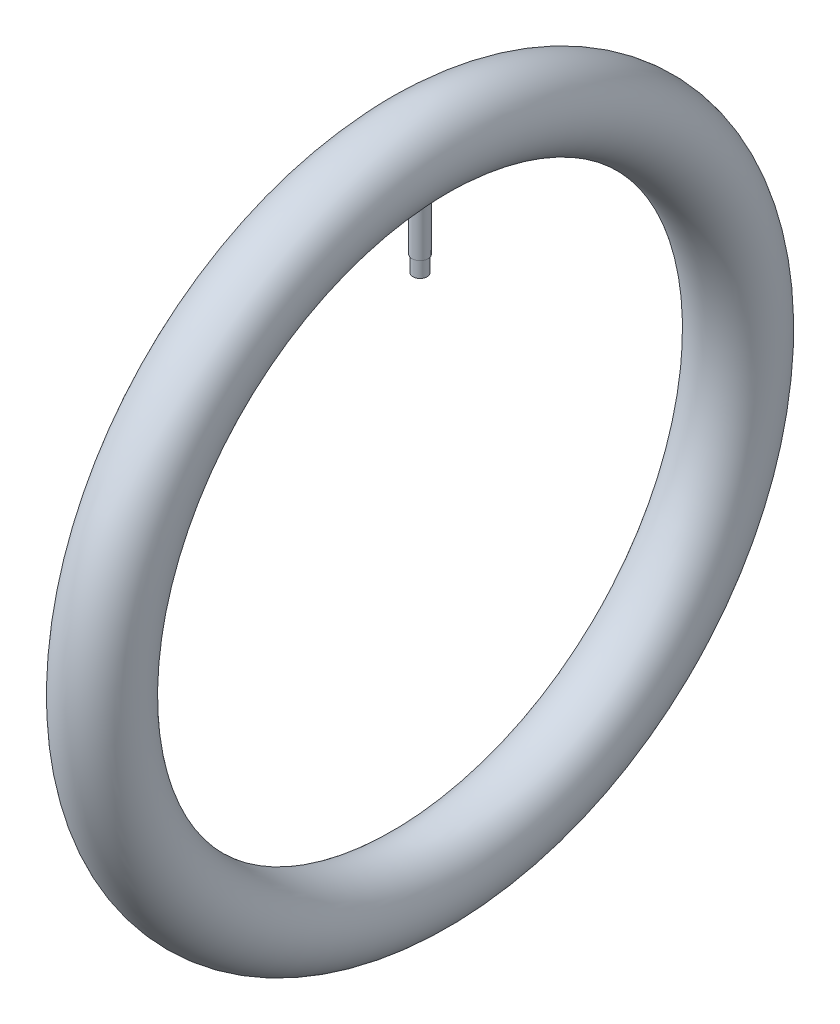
ISO-10303-21;
HEADER;
FILE_DESCRIPTION(('STEP AP214'),'2;1');
FILE_NAME('part.step','',(''),(''),'','','');
FILE_SCHEMA(('AUTOMOTIVE_DESIGN { 1 0 10303 214 1 1 1 1 }'));
ENDSEC;
DATA;
#1=APPLICATION_CONTEXT('core data for automotive mechanical design processes');
#2=APPLICATION_PROTOCOL_DEFINITION('international standard','automotive_design',2000,#1);
#3=PRODUCT_CONTEXT('',#1,'mechanical');
#4=PRODUCT('Part','Part','',(#3));
#5=PRODUCT_RELATED_PRODUCT_CATEGORY('part','',(#4));
#6=PRODUCT_DEFINITION_FORMATION('','',#4);
#7=PRODUCT_DEFINITION_CONTEXT('part definition',#1,'design');
#8=PRODUCT_DEFINITION('design','',#6,#7);
#9=PRODUCT_DEFINITION_SHAPE('','',#8);
#10=(LENGTH_UNIT() NAMED_UNIT(*) SI_UNIT(.MILLI.,.METRE.));
#11=(NAMED_UNIT(*) PLANE_ANGLE_UNIT() SI_UNIT($,.RADIAN.));
#12=(NAMED_UNIT(*) SI_UNIT($,.STERADIAN.) SOLID_ANGLE_UNIT());
#13=UNCERTAINTY_MEASURE_WITH_UNIT(LENGTH_MEASURE(1.E-05),#10,'distance_accuracy_value','');
#14=(GEOMETRIC_REPRESENTATION_CONTEXT(3) GLOBAL_UNCERTAINTY_ASSIGNED_CONTEXT((#13)) GLOBAL_UNIT_ASSIGNED_CONTEXT((#10,
#11,#12)) REPRESENTATION_CONTEXT('',''));
#15=CARTESIAN_POINT('',(0.,0.,0.));
#16=DIRECTION('',(0.,0.,1.));
#17=DIRECTION('',(1.,0.,0.));
#18=AXIS2_PLACEMENT_3D('',#15,#16,#17);
#19=CARTESIAN_POINT('',(0.,200.001,0.));
#20=DIRECTION('',(0.,-1.,0.));
#21=DIRECTION('',(0.,0.,-1.));
#22=AXIS2_PLACEMENT_3D('',#19,#20,#21);
#23=CYLINDRICAL_SURFACE('',#22,4.5);
#24=CARTESIAN_POINT('',(-3.96365629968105,156.282736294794,-4.91499477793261));
#25=CARTESIAN_POINT('',(-2.78237425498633,156.109252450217,-3.54800993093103));
#26=CARTESIAN_POINT('',(-2.99353063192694,154.316436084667,-3.35987713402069));
#27=CARTESIAN_POINT('',(-4.21302538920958,156.336156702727,-4.66937647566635));
#28=CARTESIAN_POINT('',(-2.98035954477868,156.134321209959,-3.3926569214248));
#29=CARTESIAN_POINT('',(-3.18186532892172,154.37390884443,-3.19207596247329));
#30=CARTESIAN_POINT('',(-4.4435663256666,156.390738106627,-4.40070089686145));
#31=CARTESIAN_POINT('',(-3.1709121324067,156.161819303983,-3.21585608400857));
#32=CARTESIAN_POINT('',(-3.35598016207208,154.432634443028,-3.0084993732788));
#33=CARTESIAN_POINT('',(-4.861080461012,156.496255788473,-3.82403102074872));
#34=CARTESIAN_POINT('',(-3.52279799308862,156.217741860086,-2.82360093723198));
#35=CARTESIAN_POINT('',(-3.67130552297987,154.546170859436,-2.61442298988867));
#36=CARTESIAN_POINT('',(-5.04804839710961,156.547191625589,-3.51603198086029));
#37=CARTESIAN_POINT('',(-3.68481416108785,156.246193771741,-2.60842215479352));
#38=CARTESIAN_POINT('',(-3.81251207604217,154.600981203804,-2.40391994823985));
#39=CARTESIAN_POINT('',(-5.37509358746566,156.640210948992,-2.86448778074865));
#40=CARTESIAN_POINT('',(-3.97149624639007,156.299783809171,-2.14298639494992));
#41=CARTESIAN_POINT('',(-4.05951124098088,154.701081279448,-1.95856303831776));
#42=CARTESIAN_POINT('',(-5.51456987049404,156.68217864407,-2.52055421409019));
#43=CARTESIAN_POINT('',(-4.09661153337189,156.325004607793,-1.89203452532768));
#44=CARTESIAN_POINT('',(-4.16484997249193,154.746246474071,-1.72344301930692));
#45=CARTESIAN_POINT('',(-5.738671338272,156.751280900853,-1.80994208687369));
#46=CARTESIAN_POINT('',(-4.29850886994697,156.36714443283,-1.36679484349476));
#47=CARTESIAN_POINT('',(-4.33410143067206,154.820616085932,-1.23760832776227));
#48=CARTESIAN_POINT('',(-5.82331490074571,156.778420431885,-1.44327119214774));
#49=CARTESIAN_POINT('',(-4.37613529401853,156.384223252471,-1.09168269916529));
#50=CARTESIAN_POINT('',(-4.39802803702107,154.849825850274,-0.986898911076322));
#51=CARTESIAN_POINT('',(-5.9324053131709,156.813661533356,-0.712641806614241));
#52=CARTESIAN_POINT('',(-4.47598524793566,156.40642234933,-0.540966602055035));
#53=CARTESIAN_POINT('',(-4.48041799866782,154.887755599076,-0.487310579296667));
#54=CARTESIAN_POINT('',(-5.95903879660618,156.822454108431,-0.349119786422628));
#55=CARTESIAN_POINT('',(-4.50064987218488,156.412070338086,-0.264694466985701));
#56=CARTESIAN_POINT('',(-4.50053279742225,154.897219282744,-0.238731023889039));
#57=CARTESIAN_POINT('',(-5.95759969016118,156.821981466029,0.377743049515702));
#58=CARTESIAN_POINT('',(-4.49932417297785,156.41176915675,0.286414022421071));
#59=CARTESIAN_POINT('',(-4.49944591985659,154.896710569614,0.258303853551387));
#60=CARTESIAN_POINT('',(-5.92953610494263,156.812719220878,0.74108388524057));
#61=CARTESIAN_POINT('',(-4.47333619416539,156.405820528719,0.562496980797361));
#62=CARTESIAN_POINT('',(-4.47825104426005,154.88674137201,0.506759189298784));
#63=CARTESIAN_POINT('',(-5.82142620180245,156.777826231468,1.44622033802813));
#64=CARTESIAN_POINT('',(-4.37443419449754,156.383858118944,1.09375446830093));
#65=CARTESIAN_POINT('',(-4.39660160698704,154.849186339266,0.988914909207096));
#66=CARTESIAN_POINT('',(-5.74292314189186,156.752681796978,1.78833528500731));
#67=CARTESIAN_POINT('',(-4.30250502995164,156.368054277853,1.35036713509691));
#68=CARTESIAN_POINT('',(-4.33731258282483,154.822123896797,1.22283430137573));
#69=CARTESIAN_POINT('',(-5.53807453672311,156.689348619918,2.45313109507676));
#70=CARTESIAN_POINT('',(-4.11778198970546,156.32935781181,1.84228459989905));
#71=CARTESIAN_POINT('',(-4.18260174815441,154.753962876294,1.67734841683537));
#72=CARTESIAN_POINT('',(-5.41172196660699,156.651157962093,2.77580909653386));
#73=CARTESIAN_POINT('',(-4.00431772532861,156.306337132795,2.07827985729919));
#74=CARTESIAN_POINT('',(-4.08717463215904,154.712862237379,1.89794117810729));
#75=CARTESIAN_POINT('',(-5.11107202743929,156.564737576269,3.40186107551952));
#76=CARTESIAN_POINT('',(-3.73977255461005,156.256165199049,2.5275846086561));
#77=CARTESIAN_POINT('',(-3.86011034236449,154.619862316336,2.32588412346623));
#78=CARTESIAN_POINT('',(-4.93561940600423,156.516273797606,3.70452015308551));
#79=CARTESIAN_POINT('',(-3.58703812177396,156.228816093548,2.74036620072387));
#80=CARTESIAN_POINT('',(-3.72760067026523,154.567711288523,2.53274439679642));
#81=CARTESIAN_POINT('',(-4.54302349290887,156.415123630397,4.27395900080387));
#82=CARTESIAN_POINT('',(-3.25404787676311,156.174473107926,3.13077423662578));
#83=CARTESIAN_POINT('',(-3.43109466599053,154.458872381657,2.92189409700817));
#84=CARTESIAN_POINT('',(-4.32586934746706,156.362436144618,4.54072939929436));
#85=CARTESIAN_POINT('',(-3.07312201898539,156.14744085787,3.30819885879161));
#86=CARTESIAN_POINT('',(-3.26709013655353,154.402183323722,3.1041771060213));
#87=CARTESIAN_POINT('',(-3.84538936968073,156.256122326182,5.04220224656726));
#88=CARTESIAN_POINT('',(-2.68472495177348,156.096035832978,3.63192849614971));
#89=CARTESIAN_POINT('',(-2.90421015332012,154.287802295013,3.44678869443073));
#90=CARTESIAN_POINT('',(-3.58052778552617,156.202546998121,5.27512668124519));
#91=CARTESIAN_POINT('',(-2.47624830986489,156.071896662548,3.77590868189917));
#92=CARTESIAN_POINT('',(-2.70417483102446,154.230165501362,3.60590060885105));
#93=CARTESIAN_POINT('',(-3.01803741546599,156.102661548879,5.68871276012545));
#94=CARTESIAN_POINT('',(-2.04869467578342,156.029938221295,4.02304504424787));
#95=CARTESIAN_POINT('',(-2.27935692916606,154.122714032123,3.88839129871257));
#96=CARTESIAN_POINT('',(-2.72040944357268,156.056351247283,5.86937570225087));
#97=CARTESIAN_POINT('',(-1.82983687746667,156.012256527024,4.12533412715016));
#98=CARTESIAN_POINT('',(-2.05457496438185,154.07289916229,4.0117709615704));
#99=CARTESIAN_POINT('',(-2.10179604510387,155.976440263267,6.17201135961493));
#100=CARTESIAN_POINT('',(-1.38979994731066,155.98374743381,4.29155777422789));
#101=CARTESIAN_POINT('',(-1.58737043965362,153.986944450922,4.21843167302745));
#102=CARTESIAN_POINT('',(-1.78093008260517,155.942779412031,6.29426269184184));
#103=CARTESIAN_POINT('',(-1.16940869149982,155.973029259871,4.35486886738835));
#104=CARTESIAN_POINT('',(-1.34503810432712,153.950739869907,4.30190308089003));
#105=CARTESIAN_POINT('',(-1.12392972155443,155.89180215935,6.47691088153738));
#106=CARTESIAN_POINT('',(-0.728656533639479,155.957483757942,4.44791657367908));
#107=CARTESIAN_POINT('',(-0.848842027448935,153.895911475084,4.42660710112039));
#108=CARTESIAN_POINT('',(-0.78780027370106,155.874480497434,6.53732764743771));
#109=CARTESIAN_POINT('',(-0.509496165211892,155.952748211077,4.47711797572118));
#110=CARTESIAN_POINT('',(-0.594982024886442,153.877282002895,4.46785330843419));
#111=CARTESIAN_POINT('',(-0.124848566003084,155.85858719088,6.59279376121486));
#112=CARTESIAN_POINT('',(-0.0798442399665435,155.948365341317,4.50412110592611));
#113=CARTESIAN_POINT('',(-0.0942912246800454,153.860188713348,4.50571980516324));
#114=CARTESIAN_POINT('',(0.201779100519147,155.859265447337,6.59045809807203));
#115=CARTESIAN_POINT('',(0.129393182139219,155.948540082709,4.50302104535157));
#116=CARTESIAN_POINT('',(0.152392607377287,153.860918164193,4.50412533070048));
#117=CARTESIAN_POINT('',(0.849832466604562,155.877445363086,6.5269408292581));
#118=CARTESIAN_POINT('',(0.549995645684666,155.953577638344,4.47203017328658));
#119=CARTESIAN_POINT('',(0.641831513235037,153.880470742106,4.46076217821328));
#120=CARTESIAN_POINT('',(1.17125853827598,155.894945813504,6.46576345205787));
#121=CARTESIAN_POINT('',(0.76013553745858,155.958410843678,4.44232135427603));
#122=CARTESIAN_POINT('',(0.884586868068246,153.899292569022,4.41899638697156));
#123=CARTESIAN_POINT('',(1.79519036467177,155.944466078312,6.28809409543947));
#124=CARTESIAN_POINT('',(1.17942138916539,155.973579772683,4.35161709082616));
#125=CARTESIAN_POINT('',(1.3558081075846,153.952554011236,4.29769116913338));
#126=CARTESIAN_POINT('',(2.09790157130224,155.976273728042,6.1724092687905));
#127=CARTESIAN_POINT('',(1.38750443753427,155.983753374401,4.29155498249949));
#128=CARTESIAN_POINT('',(1.5844291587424,153.986765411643,4.21870293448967));
#129=CARTESIAN_POINT('',(2.68161428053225,156.051025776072,5.8897600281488));
#130=CARTESIAN_POINT('',(1.8021259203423,156.010319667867,4.13660052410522));
#131=CARTESIAN_POINT('',(2.02527512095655,154.067170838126,4.02569122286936));
#132=CARTESIAN_POINT('',(2.96261184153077,156.093972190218,5.72278633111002));
#133=CARTESIAN_POINT('',(2.00799659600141,156.026594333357,4.04237939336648));
#134=CARTESIAN_POINT('',(2.23749705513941,154.113367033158,3.91166140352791));
#135=CARTESIAN_POINT('',(3.50373543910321,156.1879945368,5.33688402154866));
#136=CARTESIAN_POINT('',(2.41701994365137,156.065578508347,3.81340505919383));
#137=CARTESIAN_POINT('',(2.64617781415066,154.214510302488,3.64808499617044));
#138=CARTESIAN_POINT('',(3.76305124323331,156.23926528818,5.11662515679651));
#139=CARTESIAN_POINT('',(2.61978028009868,156.088339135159,3.67831542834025));
#140=CARTESIAN_POINT('',(2.84202471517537,154.2696671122,3.49762894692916));
#141=CARTESIAN_POINT('',(4.24552378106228,156.343707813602,4.63258367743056));
#142=CARTESIAN_POINT('',(3.00710175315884,156.138086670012,3.36850775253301));
#143=CARTESIAN_POINT('',(3.20640956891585,154.38203318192,3.16693725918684));
#144=CARTESIAN_POINT('',(4.4686753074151,156.396879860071,4.36879480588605));
#145=CARTESIAN_POINT('',(3.19192392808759,156.165007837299,3.19440039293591));
#146=CARTESIAN_POINT('',(3.37494358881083,154.439242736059,2.98669733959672));
#147=CARTESIAN_POINT('',(4.87478255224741,156.499944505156,3.80204310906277));
#148=CARTESIAN_POINT('',(3.53465208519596,156.219790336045,2.80825038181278));
#149=CARTESIAN_POINT('',(3.6816539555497,154.550140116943,2.59939556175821));
#150=CARTESIAN_POINT('',(5.05744521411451,156.54981147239,3.49881837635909));
#151=CARTESIAN_POINT('',(3.69303396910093,156.247688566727,2.5961815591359));
#152=CARTESIAN_POINT('',(3.81960897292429,154.603800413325,2.39215436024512));
#153=CARTESIAN_POINT('',(5.37552924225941,156.640389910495,2.86205671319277));
#154=CARTESIAN_POINT('',(3.97199361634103,156.2999199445,2.14104827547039));
#155=CARTESIAN_POINT('',(4.05984026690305,154.701273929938,1.95690067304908));
#156=CARTESIAN_POINT('',(5.51095665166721,156.681102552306,2.5285236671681));
#157=CARTESIAN_POINT('',(4.09341145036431,156.324367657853,1.89774025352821));
#158=CARTESIAN_POINT('',(4.16212110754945,154.745088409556,1.72889084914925));
#159=CARTESIAN_POINT('',(5.73050438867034,156.748726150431,1.83914468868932));
#160=CARTESIAN_POINT('',(4.29113403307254,156.365575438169,1.38843940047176));
#161=CARTESIAN_POINT('',(4.32793338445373,154.817866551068,1.25757442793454));
#162=CARTESIAN_POINT('',(5.81452868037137,156.775611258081,1.48325835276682));
#163=CARTESIAN_POINT('',(4.36811973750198,156.382465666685,1.12164504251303));
#164=CARTESIAN_POINT('',(4.39139229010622,154.846802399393,1.01424012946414));
#165=CARTESIAN_POINT('',(5.92777542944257,156.812140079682,0.760028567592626));
#166=CARTESIAN_POINT('',(4.47170804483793,156.405449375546,0.576869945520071));
#167=CARTESIAN_POINT('',(4.47692130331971,154.886118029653,0.519713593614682));
#168=CARTESIAN_POINT('',(5.95701068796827,156.821787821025,0.39268781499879));
#169=CARTESIAN_POINT('',(4.49878097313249,156.411645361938,0.297751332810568));
#170=CARTESIAN_POINT('',(4.49900107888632,154.896502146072,0.268523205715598));
#171=CARTESIAN_POINT('',(5.9595286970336,156.822615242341,-0.330820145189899));
#172=CARTESIAN_POINT('',(4.50110177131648,156.41217340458,-0.250812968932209));
#173=CARTESIAN_POINT('',(4.50090279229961,154.897392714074,-0.226217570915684));
#174=CARTESIAN_POINT('',(5.93451725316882,156.814357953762,-0.686980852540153));
#175=CARTESIAN_POINT('',(4.47794141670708,156.406869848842,-0.521480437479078));
#176=CARTESIAN_POINT('',(4.48201303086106,154.88850517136,-0.469763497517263));
#177=CARTESIAN_POINT('',(5.83293987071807,156.781517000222,-1.38930064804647));
#178=CARTESIAN_POINT('',(4.38495216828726,156.386172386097,-1.05101159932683));
#179=CARTESIAN_POINT('',(4.40529724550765,154.853158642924,-0.949995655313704));
#180=CARTESIAN_POINT('',(5.75637223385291,156.756932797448,-1.73545940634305));
#181=CARTESIAN_POINT('',(4.31473299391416,156.3706928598,-1.31093086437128));
#182=CARTESIAN_POINT('',(4.34746993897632,154.826699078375,-1.18668166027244));
#183=CARTESIAN_POINT('',(5.5546549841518,156.694395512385,-2.40727764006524));
#184=CARTESIAN_POINT('',(4.13266884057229,156.332410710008,-1.80861736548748));
#185=CARTESIAN_POINT('',(4.1951240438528,154.759394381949,-1.64600054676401));
#186=CARTESIAN_POINT('',(5.42965927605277,156.656484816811,-2.73299829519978));
#187=CARTESIAN_POINT('',(4.02028493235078,156.309501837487,-2.04718543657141));
#188=CARTESIAN_POINT('',(4.10072169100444,154.718594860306,-1.86867537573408));
#189=CARTESIAN_POINT('',(5.13484518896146,156.571421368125,-3.35716387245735));
#190=CARTESIAN_POINT('',(3.76057844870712,156.259990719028,-2.49579104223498));
#191=CARTESIAN_POINT('',(3.87806489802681,154.627054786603,-2.29533285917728));
#192=CARTESIAN_POINT('',(4.96501678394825,156.524266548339,-3.65560267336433));
#193=CARTESIAN_POINT('',(3.61248760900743,156.233276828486,-2.70611271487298));
#194=CARTESIAN_POINT('',(3.74980288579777,154.57631201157,-2.49931131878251));
#195=CARTESIAN_POINT('',(4.57697381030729,156.423508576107,-4.23016608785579));
#196=CARTESIAN_POINT('',(3.28242496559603,156.178834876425,-3.10139709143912));
#197=CARTESIAN_POINT('',(3.45673546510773,154.467894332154,-2.89196924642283));
#198=CARTESIAN_POINT('',(4.35702562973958,156.369717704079,-4.50482571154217));
#199=CARTESIAN_POINT('',(3.09867879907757,156.151081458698,-3.28463164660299));
#200=CARTESIAN_POINT('',(3.29062075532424,154.410017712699,-3.07964541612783));
#201=CARTESIAN_POINT('',(3.87884547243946,156.263179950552,-5.01030399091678));
#202=CARTESIAN_POINT('',(2.71143925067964,156.09933797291,-3.61171811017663));
#203=CARTESIAN_POINT('',(2.92947769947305,154.295395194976,-3.4249971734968));
#204=CARTESIAN_POINT('',(3.62060632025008,156.210433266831,-5.24111441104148));
#205=CARTESIAN_POINT('',(2.50759217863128,156.075403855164,-3.75496494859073));
#206=CARTESIAN_POINT('',(2.7344439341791,154.238649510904,-3.58266712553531));
#207=CARTESIAN_POINT('',(3.06551102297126,156.110428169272,-5.65773348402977));
#208=CARTESIAN_POINT('',(2.08404848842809,156.033028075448,-4.00509810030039));
#209=CARTESIAN_POINT('',(2.31521112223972,154.131068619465,-3.86723348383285));
#210=CARTESIAN_POINT('',(2.76787264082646,156.063333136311,-5.84232019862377));
#211=CARTESIAN_POINT('',(1.86435352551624,156.01487665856,-4.1101097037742));
#212=CARTESIAN_POINT('',(2.09042129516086,154.080409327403,-3.99329438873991));
#213=CARTESIAN_POINT('',(2.14709524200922,155.981562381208,-6.15314395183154));
#214=CARTESIAN_POINT('',(1.42129837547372,155.985451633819,-4.28156856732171));
#215=CARTESIAN_POINT('',(1.62158242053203,153.992453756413,-4.2055487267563));
#216=CARTESIAN_POINT('',(1.82396221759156,155.946883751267,-6.27939465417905));
#217=CARTESIAN_POINT('',(1.19871889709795,155.974324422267,-4.3471828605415));
#218=CARTESIAN_POINT('',(1.37753789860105,153.955154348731,-4.29175149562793));
#219=CARTESIAN_POINT('',(1.17125648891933,155.894818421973,-6.46624475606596));
#220=CARTESIAN_POINT('',(0.759997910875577,155.958360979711,-4.44260042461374));
#221=CARTESIAN_POINT('',(0.884585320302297,153.899155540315,-4.4193250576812));
#222=CARTESIAN_POINT('',(0.842141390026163,155.876959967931,-6.52863978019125));
#223=CARTESIAN_POINT('',(0.544939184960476,155.953442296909,-4.47286048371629));
#224=CARTESIAN_POINT('',(0.63602286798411,153.879948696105,-4.46192205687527));
#225=CARTESIAN_POINT('',(0.178679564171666,155.858899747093,-6.5917323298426));
#226=CARTESIAN_POINT('',(0.114460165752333,155.94844013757,-4.50363981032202));
#227=CARTESIAN_POINT('',(0.13494680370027,153.860524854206,-4.50499523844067));
#228=CARTESIAN_POINT('',(-0.155665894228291,155.858693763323,-6.59244459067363));
#229=CARTESIAN_POINT('',(-0.0996446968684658,155.948385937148,-4.503978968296));
#230=CARTESIAN_POINT('',(-0.117565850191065,153.860303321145,-4.50548148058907));
#231=CARTESIAN_POINT('',(-0.807321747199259,155.87563396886,-6.53327797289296));
#232=CARTESIAN_POINT('',(-0.522297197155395,155.953074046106,-4.47512350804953));
#233=CARTESIAN_POINT('',(-0.609725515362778,153.878522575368,-4.46508855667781));
#234=CARTESIAN_POINT('',(-1.12481232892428,155.892156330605,-6.47557741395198));
#235=CARTESIAN_POINT('',(-0.729544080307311,155.957617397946,-4.44715390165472));
#236=CARTESIAN_POINT('',(-0.849508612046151,153.896292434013,-4.42569652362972));
#237=CARTESIAN_POINT('',(-1.74627434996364,155.939819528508,-6.30492820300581));
#238=CARTESIAN_POINT('',(-1.14609696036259,155.97211165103,-4.36032932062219));
#239=CARTESIAN_POINT('',(-1.31886454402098,153.94755634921,-4.30918515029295));
#240=CARTESIAN_POINT('',(-2.05024494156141,155.970961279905,-6.19197609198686));
#241=CARTESIAN_POINT('',(-1.3543857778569,155.981984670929,-4.30192887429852));
#242=CARTESIAN_POINT('',(-1.54843673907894,153.981051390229,-4.23206344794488));
#243=CARTESIAN_POINT('',(-2.63991955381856,156.045002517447,-5.91298169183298));
#244=CARTESIAN_POINT('',(-1.77187811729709,156.008081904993,-4.14960936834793));
#245=CARTESIAN_POINT('',(-1.99378539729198,154.060691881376,-4.04154938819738));
#246=CARTESIAN_POINT('',(-2.92539236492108,156.088024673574,-5.74638231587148));
#247=CARTESIAN_POINT('',(-1.98038481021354,156.024253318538,-4.0559962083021));
#248=CARTESIAN_POINT('',(-2.20938724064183,154.106969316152,-3.9277764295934));
#249=CARTESIAN_POINT('',(-3.46758282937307,156.181252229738,-5.36527617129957));
#250=CARTESIAN_POINT('',(-2.38924573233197,156.062678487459,-3.83055556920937));
#251=CARTESIAN_POINT('',(-2.61887374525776,154.207257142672,-3.66747839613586));
#252=CARTESIAN_POINT('',(-3.72429330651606,156.231459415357,-5.15075748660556));
#253=CARTESIAN_POINT('',(-2.5893488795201,156.084811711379,-3.69947104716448));
#254=CARTESIAN_POINT('',(-2.81275298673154,154.261269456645,-3.52094517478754));
#255=CARTESIAN_POINT('',(-3.96365629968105,156.282736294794,-4.91499477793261));
#256=CARTESIAN_POINT('',(-2.78237425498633,156.109252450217,-3.54800993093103));
#257=CARTESIAN_POINT('',(-2.99353063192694,154.316436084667,-3.35987713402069));
#258=(BOUNDED_SURFACE() B_SPLINE_SURFACE(3,2,((#24,#25,#26),(#27,#28,#29),(#30,#31,#32),(#33,
#34,#35),(#36,#37,#38),(#39,#40,#41),(#42,#43,#44),(#45,#46,#47),(#48,#49,#50),(#51,#52,#53),
(#54,#55,#56),(#57,#58,#59),(#60,#61,#62),(#63,#64,#65),(#66,#67,#68),(#69,#70,#71),(#72,#73,
#74),(#75,#76,#77),(#78,#79,#80),(#81,#82,#83),(#84,#85,#86),(#87,#88,#89),(#90,#91,#92),(#93,
#94,#95),(#96,#97,#98),(#99,#100,#101),(#102,#103,#104),(#105,#106,#107),(#108,#109,#110),(#111,
#112,#113),(#114,#115,#116),(#117,#118,#119),(#120,#121,#122),(#123,#124,#125),(#126,#127,#128),
(#129,#130,#131),(#132,#133,#134),(#135,#136,#137),(#138,#139,#140),(#141,#142,#143),(#144,#145,
#146),(#147,#148,#149),(#150,#151,#152),(#153,#154,#155),(#156,#157,#158),(#159,#160,#161),
(#162,#163,#164),(#165,#166,#167),(#168,#169,#170),(#171,#172,#173),(#174,#175,#176),(#177,#178,
#179),(#180,#181,#182),(#183,#184,#185),(#186,#187,#188),(#189,#190,#191),(#192,#193,#194),
(#195,#196,#197),(#198,#199,#200),(#201,#202,#203),(#204,#205,#206),(#207,#208,#209),(#210,#211,
#212),(#213,#214,#215),(#216,#217,#218),(#219,#220,#221),(#222,#223,#224),(#225,#226,#227),
(#228,#229,#230),(#231,#232,#233),(#234,#235,#236),(#237,#238,#239),(#240,#241,#242),(#243,#244,
#245),(#246,#247,#248),(#249,#250,#251),(#252,#253,#254),(#255,#256,#257)),.UNSPECIFIED.,.T.,
.F.,.F.) B_SPLINE_SURFACE_WITH_KNOTS((4,2,2,2,2,2,2,2,2,2,2,2,2,2,2,2,2,2,2,2,2,2,2,2,2,2,2,2,2,
2,2,2,2,2,2,2,2,2,4),(3,3),(0.,1.10534678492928,2.21082700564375,3.32981721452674,
4.44843218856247,5.52409460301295,6.59957994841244,7.64363235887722,8.687838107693,
9.75904441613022,10.8305299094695,11.9462396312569,13.0619216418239,14.1722274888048,
15.282175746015,16.3459453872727,17.4096385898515,18.4580530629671,19.5066574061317,
20.584780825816,21.6630593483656,22.748904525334,23.8346107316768,24.9223392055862,
26.0098135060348,27.0635886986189,28.1173986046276,29.1678866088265,30.2186097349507,
31.3134931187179,32.4085819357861,33.5301275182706,34.6514102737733,35.7402159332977,
36.8287614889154,37.8781560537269,38.9276163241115,39.9883462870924,41.0493403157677),(0.,1.),
.UNSPECIFIED.) GEOMETRIC_REPRESENTATION_ITEM() RATIONAL_B_SPLINE_SURFACE(((1.,0.740528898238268,
1.),(1.,0.746417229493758,1.),(1.,0.75233940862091,1.),(1.,0.763623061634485,1.),(1.,
0.768984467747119,1.),(1.,0.778664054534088,1.),(1.,0.782968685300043,1.),(1.,0.790004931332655,
1.),(1.,0.792737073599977,1.),(1.,0.796276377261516,1.),(1.,0.797153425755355,1.),(1.,
0.797106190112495,1.),(1.,0.796182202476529,1.),(1.,0.79267693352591,1.),(1.,0.790144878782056,
1.),(1.,0.783701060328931,1.),(1.,0.779789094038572,1.),(1.,0.770820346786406,1.),(1.,
0.765736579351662,1.),(1.,0.754964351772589,1.),(1.,0.749275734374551,1.),(1.,0.737618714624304,
1.),(1.,0.731648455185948,1.),(1.,0.720354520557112,1.),(1.,0.715030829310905,1.),(1.,
0.705742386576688,1.),(1.,0.701771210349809,1.),(1.,0.69572192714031,1.),(1.,0.693643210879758,
1.),(1.,0.691736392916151,1.),(1.,0.691818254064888,1.),(1.,0.693998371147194,1.),(1.,
0.696096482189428,1.),(1.,0.701969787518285,1.),(1.,0.705720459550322,1.),(1.,0.714414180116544,
1.),(1.,0.719357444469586,1.),(1.,0.730014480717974,1.),(1.,0.735746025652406,1.),(1.,
0.74723918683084,1.),(1.,0.753000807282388,1.),(1.,0.764012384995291,1.),(1.,0.769258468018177,
1.),(1.,0.778681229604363,1.),(1.,0.782858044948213,1.),(1.,0.78974583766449,1.),(1.,
0.792454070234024,1.),(1.,0.79612437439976,1.),(1.,0.797086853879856,1.),(1.,0.79716951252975,
1.),(1.,0.796345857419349,1.),(1.,0.793048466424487,1.),(1.,0.790574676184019,1.),(1.,
0.784216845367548,1.),(1.,0.780337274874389,1.),(1.,0.771518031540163,1.),(1.,0.766578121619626,
1.),(1.,0.755865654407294,1.),(1.,0.750066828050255,1.),(1.,0.738399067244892,1.),(1.,
0.732530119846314,1.),(1.,0.721241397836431,1.),(1.,0.715835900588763,1.),(1.,0.706343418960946,
1.),(1.,0.702256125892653,1.),(1.,0.696081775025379,1.),(1.,0.693940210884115,1.),(1.,
0.691774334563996,1.),(1.,0.691749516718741,1.),(1.,0.693781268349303,1.),(1.,0.695763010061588,
1.),(1.,0.701420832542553,1.),(1.,0.705097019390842,1.),(1.,0.713718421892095,1.),(1.,
0.718676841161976,1.),(1.,0.729255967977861,1.),(1.,0.734876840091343,1.),(1.,0.740528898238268,1.))) REPRESENTATION_ITEM('') SURFACE());
#259=CARTESIAN_POINT('',(-2.99353063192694,154.316436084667,-3.35987713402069));
#260=CARTESIAN_POINT('',(-2.81275298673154,154.261269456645,-3.52094517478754));
#261=CARTESIAN_POINT('',(-2.61887374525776,154.207257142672,-3.66747839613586));
#262=CARTESIAN_POINT('',(-2.20938724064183,154.106969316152,-3.9277764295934));
#263=CARTESIAN_POINT('',(-1.99378539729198,154.060691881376,-4.04154938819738));
#264=CARTESIAN_POINT('',(-1.54843673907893,153.981051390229,-4.23206344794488));
#265=CARTESIAN_POINT('',(-1.31886454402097,153.94755634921,-4.30918515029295));
#266=CARTESIAN_POINT('',(-0.849508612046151,153.896292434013,-4.42569652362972));
#267=CARTESIAN_POINT('',(-0.609725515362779,153.878522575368,-4.46508855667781));
#268=CARTESIAN_POINT('',(-0.117565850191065,153.860303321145,-4.50548148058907));
#269=CARTESIAN_POINT('',(0.13494680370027,153.860524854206,-4.50499523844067));
#270=CARTESIAN_POINT('',(0.636022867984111,153.879948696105,-4.46192205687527));
#271=CARTESIAN_POINT('',(0.884585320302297,153.899155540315,-4.4193250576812));
#272=CARTESIAN_POINT('',(1.37753789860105,153.955154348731,-4.29175149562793));
#273=CARTESIAN_POINT('',(1.62158242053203,153.992453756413,-4.2055487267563));
#274=CARTESIAN_POINT('',(2.09042129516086,154.080409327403,-3.99329438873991));
#275=CARTESIAN_POINT('',(2.31521112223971,154.131068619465,-3.86723348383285));
#276=CARTESIAN_POINT('',(2.7344439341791,154.238649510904,-3.58266712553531));
#277=CARTESIAN_POINT('',(2.92947769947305,154.295395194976,-3.4249971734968));
#278=CARTESIAN_POINT('',(3.29062075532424,154.410017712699,-3.07964541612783));
#279=CARTESIAN_POINT('',(3.45673546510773,154.467894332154,-2.89196924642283));
#280=CARTESIAN_POINT('',(3.74980288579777,154.57631201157,-2.49931131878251));
#281=CARTESIAN_POINT('',(3.87806489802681,154.627054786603,-2.29533285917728));
#282=CARTESIAN_POINT('',(4.10072169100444,154.718594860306,-1.86867537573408));
#283=CARTESIAN_POINT('',(4.1951240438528,154.759394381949,-1.64600054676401));
#284=CARTESIAN_POINT('',(4.34746993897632,154.826699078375,-1.18668166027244));
#285=CARTESIAN_POINT('',(4.40529724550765,154.853158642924,-0.949995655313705));
#286=CARTESIAN_POINT('',(4.48201303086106,154.88850517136,-0.469763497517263));
#287=CARTESIAN_POINT('',(4.50090279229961,154.897392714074,-0.226217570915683));
#288=CARTESIAN_POINT('',(4.49900107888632,154.896502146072,0.268523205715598));
#289=CARTESIAN_POINT('',(4.47692130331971,154.886118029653,0.519713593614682));
#290=CARTESIAN_POINT('',(4.39139229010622,154.846802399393,1.01424012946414));
#291=CARTESIAN_POINT('',(4.32793338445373,154.817866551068,1.25757442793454));
#292=CARTESIAN_POINT('',(4.16212110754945,154.745088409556,1.72889084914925));
#293=CARTESIAN_POINT('',(4.05984026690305,154.701273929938,1.95690067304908));
#294=CARTESIAN_POINT('',(3.81960897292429,154.603800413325,2.39215436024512));
#295=CARTESIAN_POINT('',(3.6816539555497,154.550140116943,2.59939556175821));
#296=CARTESIAN_POINT('',(3.37494358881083,154.439242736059,2.98669733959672));
#297=CARTESIAN_POINT('',(3.20640956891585,154.38203318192,3.16693725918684));
#298=CARTESIAN_POINT('',(2.84202471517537,154.2696671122,3.49762894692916));
#299=CARTESIAN_POINT('',(2.64617781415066,154.214510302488,3.64808499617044));
#300=CARTESIAN_POINT('',(2.23749705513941,154.113367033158,3.91166140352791));
#301=CARTESIAN_POINT('',(2.02527512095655,154.067170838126,4.02569122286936));
#302=CARTESIAN_POINT('',(1.5844291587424,153.986765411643,4.21870293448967));
#303=CARTESIAN_POINT('',(1.3558081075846,153.952554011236,4.29769116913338));
#304=CARTESIAN_POINT('',(0.884586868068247,153.899292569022,4.41899638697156));
#305=CARTESIAN_POINT('',(0.641831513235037,153.880470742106,4.46076217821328));
#306=CARTESIAN_POINT('',(0.152392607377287,153.860918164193,4.50412533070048));
#307=CARTESIAN_POINT('',(-0.094291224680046,153.860188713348,4.50571980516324));
#308=CARTESIAN_POINT('',(-0.594982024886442,153.877282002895,4.46785330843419));
#309=CARTESIAN_POINT('',(-0.848842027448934,153.895911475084,4.42660710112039));
#310=CARTESIAN_POINT('',(-1.34503810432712,153.950739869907,4.30190308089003));
#311=CARTESIAN_POINT('',(-1.58737043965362,153.986944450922,4.21843167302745));
#312=CARTESIAN_POINT('',(-2.05457496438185,154.07289916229,4.0117709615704));
#313=CARTESIAN_POINT('',(-2.27935692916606,154.122714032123,3.88839129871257));
#314=CARTESIAN_POINT('',(-2.70417483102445,154.230165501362,3.60590060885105));
#315=CARTESIAN_POINT('',(-2.90421015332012,154.287802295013,3.44678869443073));
#316=CARTESIAN_POINT('',(-3.26709013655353,154.402183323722,3.1041771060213));
#317=CARTESIAN_POINT('',(-3.43109466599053,154.458872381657,2.92189409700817));
#318=CARTESIAN_POINT('',(-3.72760067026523,154.567711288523,2.53274439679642));
#319=CARTESIAN_POINT('',(-3.86011034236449,154.619862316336,2.32588412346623));
#320=CARTESIAN_POINT('',(-4.08717463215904,154.712862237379,1.89794117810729));
#321=CARTESIAN_POINT('',(-4.18260174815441,154.753962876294,1.67734841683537));
#322=CARTESIAN_POINT('',(-4.33731258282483,154.822123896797,1.22283430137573));
#323=CARTESIAN_POINT('',(-4.39660160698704,154.849186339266,0.988914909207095));
#324=CARTESIAN_POINT('',(-4.47825104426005,154.88674137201,0.506759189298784));
#325=CARTESIAN_POINT('',(-4.49944591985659,154.896710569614,0.258303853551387));
#326=CARTESIAN_POINT('',(-4.50053279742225,154.897219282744,-0.238731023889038));
#327=CARTESIAN_POINT('',(-4.48041799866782,154.887755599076,-0.487310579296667));
#328=CARTESIAN_POINT('',(-4.39802803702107,154.849825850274,-0.986898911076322));
#329=CARTESIAN_POINT('',(-4.33410143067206,154.820616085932,-1.23760832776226));
#330=CARTESIAN_POINT('',(-4.16484997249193,154.746246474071,-1.72344301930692));
#331=CARTESIAN_POINT('',(-4.05951124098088,154.701081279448,-1.95856303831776));
#332=CARTESIAN_POINT('',(-3.81251207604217,154.600981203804,-2.40391994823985));
#333=CARTESIAN_POINT('',(-3.67130552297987,154.546170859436,-2.61442298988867));
#334=CARTESIAN_POINT('',(-3.35598016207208,154.432634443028,-3.0084993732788));
#335=CARTESIAN_POINT('',(-3.18186532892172,154.37390884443,-3.19207596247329));
#336=CARTESIAN_POINT('',(-2.99353063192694,154.316436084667,-3.35987713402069));
#337=B_SPLINE_CURVE_WITH_KNOTS('',3,(#259,#260,#261,#262,#263,#264,#265,#266,#267,#268,#269,
#270,#271,#272,#273,#274,#275,#276,#277,#278,#279,#280,#281,#282,#283,#284,#285,#286,#287,#288,
#289,#290,#291,#292,#293,#294,#295,#296,#297,#298,#299,#300,#301,#302,#303,#304,#305,#306,#307,
#308,#309,#310,#311,#312,#313,#314,#315,#316,#317,#318,#319,#320,#321,#322,#323,#324,#325,#326,
#327,#328,#329,#330,#331,#332,#333,#334,#335,#336),.UNSPECIFIED.,.T.,.F.,(4,2,2,2,2,2,2,2,2,2,2,
2,2,2,2,2,2,2,2,2,2,2,2,2,2,2,2,2,2,2,2,2,2,2,2,2,2,2,4),(0.,1.06099402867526,2.12172399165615,
3.1711842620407,4.22057882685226,5.30912438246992,6.39793004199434,7.51921279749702,
8.6407583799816,9.73584719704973,10.8307305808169,11.8814537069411,12.93194171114,
13.9857516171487,15.0395268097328,16.1270011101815,17.2147295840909,18.3004357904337,
19.3862809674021,20.4645594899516,21.542682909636,22.5912872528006,23.6397017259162,
24.703394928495,25.7671645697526,26.8771128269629,27.9874186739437,29.1031006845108,
30.2188104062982,31.2902958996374,32.3615022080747,33.4057079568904,34.4497603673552,
35.5252457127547,36.6009081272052,37.7195231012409,38.8385133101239,39.9439935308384,
41.0493403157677),.UNSPECIFIED.);
#338=CARTESIAN_POINT('',(-2.99353063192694,154.316436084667,-3.35987713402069));
#339=VERTEX_POINT('',#338);
#340=EDGE_CURVE('E47',#339,#339,#337,.T.);
#341=ORIENTED_EDGE('',*,*,#340,.T.);
#342=EDGE_LOOP('',(#341));
#343=FACE_BOUND('',#342,.T.);
#344=CARTESIAN_POINT('',(0.,125.,0.));
#345=DIRECTION('',(0.,-1.,0.));
#346=DIRECTION('',(0.,0.,-1.));
#347=AXIS2_PLACEMENT_3D('',#344,#345,#346);
#348=CIRCLE('',#347,4.5);
#349=CARTESIAN_POINT('',(0.,125.,-4.5));
#350=VERTEX_POINT('',#349);
#351=EDGE_CURVE('E51',#350,#350,#348,.T.);
#352=ORIENTED_EDGE('',*,*,#351,.F.);
#353=EDGE_LOOP('',(#352));
#354=FACE_BOUND('',#353,.T.);
#355=ADVANCED_FACE('F34',(#343,#354),#23,.T.);
#356=CARTESIAN_POINT('',(0.,0.,0.));
#357=DIRECTION('',(-1.,0.,0.));
#358=DIRECTION('',(0.,0.,1.));
#359=AXIS2_PLACEMENT_3D('',#356,#357,#358);
#360=TOROIDAL_SURFACE('',#359,178.,22.);
#361=CARTESIAN_POINT('',(-3.96365629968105,156.282736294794,-4.91499477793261));
#362=CARTESIAN_POINT('',(-4.21302538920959,156.336156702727,-4.66937647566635));
#363=CARTESIAN_POINT('',(-4.4435663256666,156.390738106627,-4.40070089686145));
#364=CARTESIAN_POINT('',(-4.861080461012,156.496255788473,-3.82403102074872));
#365=CARTESIAN_POINT('',(-5.04804839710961,156.547191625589,-3.51603198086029));
#366=CARTESIAN_POINT('',(-5.37509358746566,156.640210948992,-2.86448778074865));
#367=CARTESIAN_POINT('',(-5.51456987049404,156.68217864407,-2.52055421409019));
#368=CARTESIAN_POINT('',(-5.738671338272,156.751280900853,-1.80994208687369));
#369=CARTESIAN_POINT('',(-5.82331490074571,156.778420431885,-1.44327119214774));
#370=CARTESIAN_POINT('',(-5.9324053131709,156.813661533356,-0.712641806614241));
#371=CARTESIAN_POINT('',(-5.95903879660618,156.822454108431,-0.349119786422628));
#372=CARTESIAN_POINT('',(-5.95759969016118,156.821981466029,0.377743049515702));
#373=CARTESIAN_POINT('',(-5.92953610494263,156.812719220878,0.74108388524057));
#374=CARTESIAN_POINT('',(-5.82142620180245,156.777826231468,1.44622033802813));
#375=CARTESIAN_POINT('',(-5.74292314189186,156.752681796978,1.78833528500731));
#376=CARTESIAN_POINT('',(-5.53807453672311,156.689348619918,2.45313109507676));
#377=CARTESIAN_POINT('',(-5.41172196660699,156.651157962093,2.77580909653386));
#378=CARTESIAN_POINT('',(-5.1110720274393,156.564737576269,3.40186107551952));
#379=CARTESIAN_POINT('',(-4.93561940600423,156.516273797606,3.70452015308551));
#380=CARTESIAN_POINT('',(-4.54302349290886,156.415123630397,4.27395900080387));
#381=CARTESIAN_POINT('',(-4.32586934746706,156.362436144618,4.54072939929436));
#382=CARTESIAN_POINT('',(-3.84538936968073,156.256122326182,5.04220224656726));
#383=CARTESIAN_POINT('',(-3.58052778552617,156.202546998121,5.27512668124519));
#384=CARTESIAN_POINT('',(-3.01803741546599,156.102661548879,5.68871276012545));
#385=CARTESIAN_POINT('',(-2.72040944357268,156.056351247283,5.86937570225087));
#386=CARTESIAN_POINT('',(-2.10179604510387,155.976440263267,6.17201135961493));
#387=CARTESIAN_POINT('',(-1.78093008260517,155.942779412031,6.29426269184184));
#388=CARTESIAN_POINT('',(-1.12392972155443,155.89180215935,6.47691088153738));
#389=CARTESIAN_POINT('',(-0.78780027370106,155.874480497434,6.53732764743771));
#390=CARTESIAN_POINT('',(-0.124848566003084,155.85858719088,6.59279376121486));
#391=CARTESIAN_POINT('',(0.201779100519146,155.859265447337,6.59045809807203));
#392=CARTESIAN_POINT('',(0.849832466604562,155.877445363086,6.5269408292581));
#393=CARTESIAN_POINT('',(1.17125853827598,155.894945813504,6.46576345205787));
#394=CARTESIAN_POINT('',(1.79519036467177,155.944466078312,6.28809409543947));
#395=CARTESIAN_POINT('',(2.09790157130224,155.976273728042,6.1724092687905));
#396=CARTESIAN_POINT('',(2.68161428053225,156.051025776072,5.8897600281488));
#397=CARTESIAN_POINT('',(2.96261184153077,156.093972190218,5.72278633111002));
#398=CARTESIAN_POINT('',(3.50373543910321,156.1879945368,5.33688402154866));
#399=CARTESIAN_POINT('',(3.76305124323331,156.23926528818,5.11662515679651));
#400=CARTESIAN_POINT('',(4.24552378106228,156.343707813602,4.63258367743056));
#401=CARTESIAN_POINT('',(4.46867530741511,156.396879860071,4.36879480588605));
#402=CARTESIAN_POINT('',(4.87478255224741,156.499944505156,3.80204310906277));
#403=CARTESIAN_POINT('',(5.05744521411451,156.54981147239,3.49881837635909));
#404=CARTESIAN_POINT('',(5.37552924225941,156.640389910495,2.86205671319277));
#405=CARTESIAN_POINT('',(5.51095665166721,156.681102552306,2.5285236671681));
#406=CARTESIAN_POINT('',(5.73050438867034,156.748726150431,1.83914468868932));
#407=CARTESIAN_POINT('',(5.81452868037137,156.775611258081,1.48325835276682));
#408=CARTESIAN_POINT('',(5.92777542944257,156.812140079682,0.760028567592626));
#409=CARTESIAN_POINT('',(5.95701068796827,156.821787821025,0.392687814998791));
#410=CARTESIAN_POINT('',(5.9595286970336,156.822615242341,-0.330820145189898));
#411=CARTESIAN_POINT('',(5.93451725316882,156.814357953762,-0.686980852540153));
#412=CARTESIAN_POINT('',(5.83293987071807,156.781517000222,-1.38930064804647));
#413=CARTESIAN_POINT('',(5.75637223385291,156.756932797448,-1.73545940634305));
#414=CARTESIAN_POINT('',(5.5546549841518,156.694395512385,-2.40727764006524));
#415=CARTESIAN_POINT('',(5.42965927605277,156.656484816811,-2.73299829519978));
#416=CARTESIAN_POINT('',(5.13484518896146,156.571421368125,-3.35716387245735));
#417=CARTESIAN_POINT('',(4.96501678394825,156.524266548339,-3.65560267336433));
#418=CARTESIAN_POINT('',(4.57697381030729,156.423508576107,-4.23016608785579));
#419=CARTESIAN_POINT('',(4.35702562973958,156.369717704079,-4.50482571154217));
#420=CARTESIAN_POINT('',(3.87884547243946,156.263179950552,-5.01030399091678));
#421=CARTESIAN_POINT('',(3.62060632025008,156.210433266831,-5.24111441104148));
#422=CARTESIAN_POINT('',(3.06551102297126,156.110428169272,-5.65773348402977));
#423=CARTESIAN_POINT('',(2.76787264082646,156.063333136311,-5.84232019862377));
#424=CARTESIAN_POINT('',(2.14709524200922,155.981562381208,-6.15314395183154));
#425=CARTESIAN_POINT('',(1.82396221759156,155.946883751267,-6.27939465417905));
#426=CARTESIAN_POINT('',(1.17125648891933,155.894818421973,-6.46624475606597));
#427=CARTESIAN_POINT('',(0.842141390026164,155.876959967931,-6.52863978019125));
#428=CARTESIAN_POINT('',(0.178679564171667,155.858899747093,-6.5917323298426));
#429=CARTESIAN_POINT('',(-0.155665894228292,155.858693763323,-6.59244459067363));
#430=CARTESIAN_POINT('',(-0.80732174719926,155.87563396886,-6.53327797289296));
#431=CARTESIAN_POINT('',(-1.12481232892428,155.892156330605,-6.47557741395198));
#432=CARTESIAN_POINT('',(-1.74627434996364,155.939819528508,-6.30492820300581));
#433=CARTESIAN_POINT('',(-2.05024494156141,155.970961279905,-6.19197609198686));
#434=CARTESIAN_POINT('',(-2.63991955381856,156.045002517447,-5.91298169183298));
#435=CARTESIAN_POINT('',(-2.92539236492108,156.088024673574,-5.74638231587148));
#436=CARTESIAN_POINT('',(-3.46758282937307,156.181252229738,-5.36527617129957));
#437=CARTESIAN_POINT('',(-3.72429330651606,156.231459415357,-5.15075748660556));
#438=CARTESIAN_POINT('',(-3.96365629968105,156.282736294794,-4.91499477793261));
#439=B_SPLINE_CURVE_WITH_KNOTS('',3,(#361,#362,#363,#364,#365,#366,#367,#368,#369,#370,#371,
#372,#373,#374,#375,#376,#377,#378,#379,#380,#381,#382,#383,#384,#385,#386,#387,#388,#389,#390,
#391,#392,#393,#394,#395,#396,#397,#398,#399,#400,#401,#402,#403,#404,#405,#406,#407,#408,#409,
#410,#411,#412,#413,#414,#415,#416,#417,#418,#419,#420,#421,#422,#423,#424,#425,#426,#427,#428,
#429,#430,#431,#432,#433,#434,#435,#436,#437,#438),.UNSPECIFIED.,.T.,.F.,(4,2,2,2,2,2,2,2,2,2,2,
2,2,2,2,2,2,2,2,2,2,2,2,2,2,2,2,2,2,2,2,2,2,2,2,2,2,2,4),(0.,1.10534678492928,2.21082700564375,
3.32981721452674,4.44843218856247,5.52409460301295,6.59957994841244,7.64363235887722,
8.687838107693,9.75904441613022,10.8305299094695,11.9462396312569,13.0619216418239,
14.1722274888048,15.282175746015,16.3459453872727,17.4096385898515,18.4580530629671,
19.5066574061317,20.584780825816,21.6630593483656,22.748904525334,23.8346107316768,
24.9223392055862,26.0098135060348,27.0635886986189,28.1173986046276,29.1678866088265,
30.2186097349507,31.3134931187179,32.4085819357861,33.5301275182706,34.6514102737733,
35.7402159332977,36.8287614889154,37.8781560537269,38.9276163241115,39.9883462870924,
41.0493403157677),.UNSPECIFIED.);
#440=CARTESIAN_POINT('',(-3.96365629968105,156.282736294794,-4.91499477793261));
#441=VERTEX_POINT('',#440);
#442=EDGE_CURVE('E10',#441,#441,#439,.T.);
#443=ORIENTED_EDGE('',*,*,#442,.T.);
#444=EDGE_LOOP('',(#443));
#445=FACE_BOUND('',#444,.T.);
#446=ADVANCED_FACE('F60',(#445),#360,.T.);
#447=CARTESIAN_POINT('',(-4.32398869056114,154.316436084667,-4.8531558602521));
#448=DIRECTION('',(0.737519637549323,-0.155818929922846,-0.657103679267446));
#449=DIRECTION('',(0.180166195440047,0.983150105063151,-0.0309194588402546));
#450=AXIS2_PLACEMENT_3D('',#447,#448,#449);
#451=CIRCLE('',#450,2.);
#452=EDGE_CURVE('',#441,#339,#451,.T.);
#453=ORIENTED_EDGE('',*,*,#442,.F.);
#454=ORIENTED_EDGE('',*,*,#340,.F.);
#455=ORIENTED_EDGE('',*,*,#452,.T.);
#456=ORIENTED_EDGE('',*,*,#452,.F.);
#457=EDGE_LOOP('',(#453,#455,#454,#456));
#458=FACE_BOUND('',#457,.T.);
#459=ADVANCED_FACE('F63',(#458),#258,.F.);
#460=CARTESIAN_POINT('',(0.,125.,0.));
#461=DIRECTION('',(0.,-1.,0.));
#462=DIRECTION('',(0.,0.,-1.));
#463=AXIS2_PLACEMENT_3D('',#460,#461,#462);
#464=PLANE('',#463);
#465=CARTESIAN_POINT('',(0.,125.,0.));
#466=DIRECTION('',(0.,-1.,0.));
#467=DIRECTION('',(0.,0.,-1.));
#468=AXIS2_PLACEMENT_3D('',#465,#466,#467);
#469=CIRCLE('',#468,4.);
#470=CARTESIAN_POINT('',(0.,125.,-4.));
#471=VERTEX_POINT('',#470);
#472=EDGE_CURVE('E108',#471,#471,#469,.T.);
#473=ORIENTED_EDGE('',*,*,#472,.F.);
#474=EDGE_LOOP('',(#473));
#475=FACE_BOUND('',#474,.T.);
#476=ORIENTED_EDGE('',*,*,#351,.T.);
#477=EDGE_LOOP('',(#476));
#478=FACE_BOUND('',#477,.T.);
#479=ADVANCED_FACE('F72',(#475,#478),#464,.T.);
#480=CARTESIAN_POINT('',(0.,125.,0.));
#481=DIRECTION('',(0.,-1.,0.));
#482=DIRECTION('',(0.,0.,-1.));
#483=AXIS2_PLACEMENT_3D('',#480,#481,#482);
#484=CYLINDRICAL_SURFACE('',#483,4.);
#485=ORIENTED_EDGE('',*,*,#472,.T.);
#486=EDGE_LOOP('',(#485));
#487=FACE_BOUND('',#486,.T.);
#488=CARTESIAN_POINT('',(0.,116.,0.));
#489=DIRECTION('',(0.,-1.,0.));
#490=DIRECTION('',(0.,0.,-1.));
#491=AXIS2_PLACEMENT_3D('',#488,#489,#490);
#492=CIRCLE('',#491,4.);
#493=CARTESIAN_POINT('',(0.,116.,-4.));
#494=VERTEX_POINT('',#493);
#495=EDGE_CURVE('E110',#494,#494,#492,.T.);
#496=ORIENTED_EDGE('',*,*,#495,.F.);
#497=EDGE_LOOP('',(#496));
#498=FACE_BOUND('',#497,.T.);
#499=ADVANCED_FACE('F89',(#487,#498),#484,.T.);
#500=CARTESIAN_POINT('',(0.,116.,0.));
#501=DIRECTION('',(0.,1.,0.));
#502=DIRECTION('',(0.,0.,1.));
#503=AXIS2_PLACEMENT_3D('',#500,#501,#502);
#504=PLANE('',#503);
#505=CARTESIAN_POINT('',(0.,116.,0.));
#506=DIRECTION('',(0.,-1.,0.));
#507=DIRECTION('',(0.,0.,-1.));
#508=AXIS2_PLACEMENT_3D('',#505,#506,#507);
#509=CIRCLE('',#508,3.25);
#510=CARTESIAN_POINT('',(0.,116.,-3.25));
#511=VERTEX_POINT('',#510);
#512=EDGE_CURVE('E115',#511,#511,#509,.T.);
#513=ORIENTED_EDGE('',*,*,#512,.F.);
#514=EDGE_LOOP('',(#513));
#515=FACE_BOUND('',#514,.T.);
#516=ORIENTED_EDGE('',*,*,#495,.T.);
#517=EDGE_LOOP('',(#516));
#518=FACE_BOUND('',#517,.T.);
#519=ADVANCED_FACE('F86',(#515,#518),#504,.F.);
#520=CARTESIAN_POINT('',(0.,166.,0.));
#521=DIRECTION('',(0.,-1.,0.));
#522=DIRECTION('',(0.,0.,-1.));
#523=AXIS2_PLACEMENT_3D('',#520,#521,#522);
#524=CYLINDRICAL_SURFACE('',#523,3.25);
#525=CARTESIAN_POINT('',(-2.20742844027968,157.098232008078,-2.38532171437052));
#526=CARTESIAN_POINT('',(-2.34129502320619,157.114264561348,-2.26143012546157));
#527=CARTESIAN_POINT('',(-2.46476747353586,157.130528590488,-2.12619522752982));
#528=CARTESIAN_POINT('',(-2.68742535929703,157.16169871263,-1.83674674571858));
#529=CARTESIAN_POINT('',(-2.78658927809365,157.176603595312,-1.68251652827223));
#530=CARTESIAN_POINT('',(-2.95771949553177,157.203357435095,-1.3593442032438));
#531=CARTESIAN_POINT('',(-3.02968216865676,157.215205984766,-1.19040013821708));
#532=CARTESIAN_POINT('',(-3.14420014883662,157.234471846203,-0.842621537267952));
#533=CARTESIAN_POINT('',(-3.18676332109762,157.241890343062,-0.663789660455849));
#534=CARTESIAN_POINT('',(-3.24092164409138,157.251384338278,-0.303096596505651));
#535=CARTESIAN_POINT('',(-3.25280731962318,157.253509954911,-0.121280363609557));
#536=CARTESIAN_POINT('',(-3.24607587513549,157.252316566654,0.241767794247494));
#537=CARTESIAN_POINT('',(-3.22745924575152,157.248997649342,0.422999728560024));
#538=CARTESIAN_POINT('',(-3.1605924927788,157.237351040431,0.778165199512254));
#539=CARTESIAN_POINT('',(-3.1125903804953,157.229065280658,0.952146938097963));
#540=CARTESIAN_POINT('',(-2.98861063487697,157.208457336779,1.28958145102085));
#541=CARTESIAN_POINT('',(-2.91263146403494,157.196134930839,1.45303364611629));
#542=CARTESIAN_POINT('',(-2.73408035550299,157.168698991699,1.76638372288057));
#543=CARTESIAN_POINT('',(-2.63127784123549,157.153561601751,1.91614807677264));
#544=CARTESIAN_POINT('',(-2.40226726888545,157.122247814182,2.19644522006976));
#545=CARTESIAN_POINT('',(-2.27605730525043,157.106071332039,2.3269764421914));
#546=CARTESIAN_POINT('',(-2.00195388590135,157.07425972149,2.56675680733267));
#547=CARTESIAN_POINT('',(-1.85381234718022,157.058633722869,2.67572381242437));
#548=CARTESIAN_POINT('',(-1.54111319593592,157.029892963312,2.86724295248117));
#549=CARTESIAN_POINT('',(-1.37655594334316,157.016778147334,2.94979566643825));
#550=CARTESIAN_POINT('',(-1.0361794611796,156.99458016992,3.08582428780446));
#551=CARTESIAN_POINT('',(-0.860397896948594,156.985484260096,3.13939226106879));
#552=CARTESIAN_POINT('',(-0.502151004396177,156.972300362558,3.21619272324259));
#553=CARTESIAN_POINT('',(-0.319686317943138,156.968211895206,3.23942811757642));
#554=CARTESIAN_POINT('',(0.0441019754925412,156.965529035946,3.25472766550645));
#555=CARTESIAN_POINT('',(0.225407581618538,156.966861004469,3.24720961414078));
#556=CARTESIAN_POINT('',(0.58413436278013,156.974702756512,3.20218119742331));
#557=CARTESIAN_POINT('',(0.761555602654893,156.981212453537,3.16467133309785));
#558=CARTESIAN_POINT('',(1.10699882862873,156.998658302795,3.06096153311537));
#559=CARTESIAN_POINT('',(1.27504653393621,157.009581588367,2.99484495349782));
#560=CARTESIAN_POINT('',(1.5977153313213,157.034657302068,2.83587020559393));
#561=CARTESIAN_POINT('',(1.75233538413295,157.048809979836,2.74300996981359));
#562=CARTESIAN_POINT('',(2.04578981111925,157.078992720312,2.53185967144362));
#563=CARTESIAN_POINT('',(2.18440992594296,157.095043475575,2.41327477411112));
#564=CARTESIAN_POINT('',(2.43991297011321,157.127108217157,2.15461727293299));
#565=CARTESIAN_POINT('',(2.5567945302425,157.143122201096,2.01454331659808));
#566=CARTESIAN_POINT('',(2.7665113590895,157.173465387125,1.7153919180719));
#567=CARTESIAN_POINT('',(2.85912736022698,157.187778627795,1.55615897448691));
#568=CARTESIAN_POINT('',(3.01624770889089,157.212911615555,1.22412298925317));
#569=CARTESIAN_POINT('',(3.08075380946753,157.223731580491,1.05132079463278));
#570=CARTESIAN_POINT('',(3.1792736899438,157.240543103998,0.698552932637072));
#571=CARTESIAN_POINT('',(3.21353628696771,157.246574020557,0.51865868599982));
#572=CARTESIAN_POINT('',(3.25140013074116,157.253250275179,0.155579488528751));
#573=CARTESIAN_POINT('',(3.25500400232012,157.253896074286,-0.0276051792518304));
#574=CARTESIAN_POINT('',(3.23159191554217,157.249754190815,-0.389622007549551));
#575=CARTESIAN_POINT('',(3.20495977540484,157.245034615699,-0.568479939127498));
#576=CARTESIAN_POINT('',(3.12251964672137,157.230813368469,-0.919137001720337));
#577=CARTESIAN_POINT('',(3.06671104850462,157.221311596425,-1.0909359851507));
#578=CARTESIAN_POINT('',(2.92737681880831,157.198564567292,-1.42320619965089));
#579=CARTESIAN_POINT('',(2.84377185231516,157.185308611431,-1.58364339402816));
#580=CARTESIAN_POINT('',(2.65126537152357,157.156538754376,-1.88832519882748));
#581=CARTESIAN_POINT('',(2.54236156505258,157.141024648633,-2.03256834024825));
#582=CARTESIAN_POINT('',(2.3005642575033,157.109218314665,-2.30287576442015));
#583=CARTESIAN_POINT('',(2.16736026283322,157.092918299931,-2.42866152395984));
#584=CARTESIAN_POINT('',(1.88164688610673,157.061561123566,-2.6561728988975));
#585=CARTESIAN_POINT('',(1.72913699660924,157.04650399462,-2.7578978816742));
#586=CARTESIAN_POINT('',(1.4084361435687,157.019268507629,-2.93469688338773));
#587=CARTESIAN_POINT('',(1.24019272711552,157.007100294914,-3.00967743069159));
#588=CARTESIAN_POINT('',(0.893242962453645,156.987095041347,-3.13022909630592));
#589=CARTESIAN_POINT('',(0.714537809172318,156.979257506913,-3.17580356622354));
#590=CARTESIAN_POINT('',(0.354051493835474,156.968875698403,-3.23575800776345));
#591=CARTESIAN_POINT('',(0.17233395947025,156.96626835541,-3.25050975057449));
#592=CARTESIAN_POINT('',(-0.191038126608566,156.966452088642,-3.24946333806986));
#593=CARTESIAN_POINT('',(-0.372692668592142,156.969243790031,-3.23366164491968));
#594=CARTESIAN_POINT('',(-0.729144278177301,156.97986391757,-3.17226977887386));
#595=CARTESIAN_POINT('',(-0.9039861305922,156.98764983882,-3.12693094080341));
#596=CARTESIAN_POINT('',(-1.24345658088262,157.00735588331,-3.00809064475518));
#597=CARTESIAN_POINT('',(-1.40809310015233,157.019272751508,-2.93461135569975));
#598=CARTESIAN_POINT('',(-1.68138080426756,157.042424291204,-2.78442255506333));
#599=CARTESIAN_POINT('',(-1.79338368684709,157.053016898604,-2.71362411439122));
#600=CARTESIAN_POINT('',(-2.00788794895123,157.075109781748,-2.55897808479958));
#601=CARTESIAN_POINT('',(-2.11038911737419,157.086610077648,-2.47513020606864));
#602=CARTESIAN_POINT('',(-2.20742844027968,157.098232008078,-2.38532171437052));
#603=B_SPLINE_CURVE_WITH_KNOTS('',3,(#525,#526,#527,#528,#529,#530,#531,#532,#533,#534,#535,
#536,#537,#538,#539,#540,#541,#542,#543,#544,#545,#546,#547,#548,#549,#550,#551,#552,#553,#554,
#555,#556,#557,#558,#559,#560,#561,#562,#563,#564,#565,#566,#567,#568,#569,#570,#571,#572,#573,
#574,#575,#576,#577,#578,#579,#580,#581,#582,#583,#584,#585,#586,#587,#588,#589,#590,#591,#592,
#593,#594,#595,#596,#597,#598,#599,#600,#601,#602),.UNSPECIFIED.,.T.,.F.,(4,2,2,2,2,2,2,2,2,2,2,
2,2,2,2,2,2,2,2,2,2,2,2,2,2,2,2,2,2,2,2,2,2,2,2,2,2,2,4),(0.,0.548831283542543,1.09814662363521,
1.64753515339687,2.19677664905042,2.74079725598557,3.28480911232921,3.82429166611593,
4.36380387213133,4.90811601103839,5.45247248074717,6.00353831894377,6.55459207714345,
7.10388506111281,7.65312542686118,8.19492914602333,8.73672381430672,9.27695028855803,
9.81721853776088,10.3640410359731,10.910897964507,11.4625380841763,12.01414379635,
12.561167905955,13.108145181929,13.6482559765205,14.1883780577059,14.7300551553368,
15.2717813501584,15.8209878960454,16.3702088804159,16.9213310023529,17.4723902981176,
18.0167636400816,18.561200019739,19.1010631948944,19.6405019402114,20.038338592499,
20.4361840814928),.UNSPECIFIED.);
#604=CARTESIAN_POINT('',(-2.20742844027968,157.098232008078,-2.38532171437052));
#605=VERTEX_POINT('',#604);
#606=EDGE_CURVE('E39',#605,#605,#603,.T.);
#607=ORIENTED_EDGE('',*,*,#606,.T.);
#608=EDGE_LOOP('',(#607));
#609=FACE_BOUND('',#608,.T.);
#610=ORIENTED_EDGE('',*,*,#512,.T.);
#611=EDGE_LOOP('',(#610));
#612=FACE_BOUND('',#611,.T.);
#613=ADVANCED_FACE('F88',(#609,#612),#524,.F.);
#614=CARTESIAN_POINT('',(0.,0.,0.));
#615=DIRECTION('',(-1.,0.,0.));
#616=DIRECTION('',(0.,0.,1.));
#617=AXIS2_PLACEMENT_3D('',#614,#615,#616);
#618=TOROIDAL_SURFACE('',#617,178.,21.);
#619=ORIENTED_EDGE('',*,*,#606,.F.);
#620=EDGE_LOOP('',(#619));
#621=FACE_BOUND('',#620,.T.);
#622=ADVANCED_FACE('F64',(#621),#618,.F.);
#623=CLOSED_SHELL('',(#355,#446,#459,#479,#499,#519,#613,#622));
#624=MANIFOLD_SOLID_BREP('B2',#623);
#625=ADVANCED_BREP_SHAPE_REPRESENTATION('',(#18,#624),#14);
#626=SHAPE_DEFINITION_REPRESENTATION(#9,#625);
ENDSEC;
END-ISO-10303-21;
